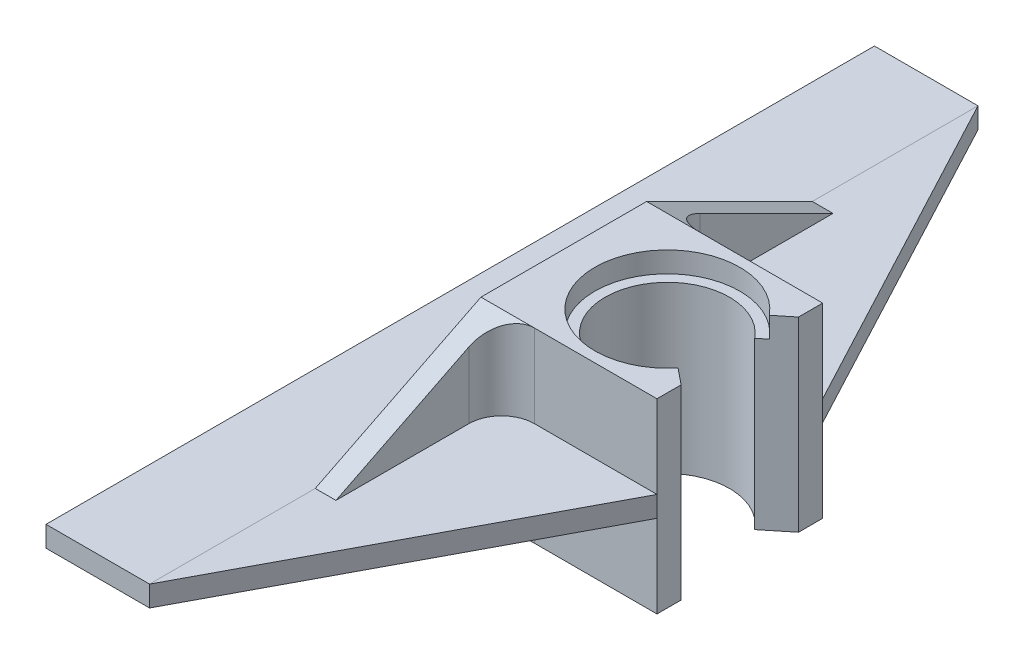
from build123d import *

# Parameters (mm, degrees)
EXTRUDE1_DEPTH = 9
SKETCH2_R      = 7
EXTRUDE2_DEPTH = 2
EXTRUDE3_DEPTH = 1
EXTRUDE4_DEPTH = 2
FILLET1_R      = 3.175


with BuildPart() as part:
    # Sketch1 → Extrude1 (new, symmetric)
    with BuildSketch(Plane(origin=(0, 0, 0), x_dir=(1, 0, 0), z_dir=(0, 1, 0))):
        with BuildLine():
            Line((-10, 8), (7, 8))
            Line((7, 8), (7, 5.668488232))
            Line((7, 5.668488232), (4.662875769, 3.775922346))
            ThreePointArc((4.662875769, 3.775922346), (-6, 0), (4.662875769, -3.775922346))
            Line((4.662875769, -3.775922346), (7, -5.668488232))
            Line((7, -5.668488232), (7, -8))
            Line((7, -8), (-10, -8))
            Line((-10, -8), (-10, 8))
        make_face()
    extrude(amount=EXTRUDE1_DEPTH, both=True)

    # Sketch2 → Extrude2 (cut)
    with BuildSketch(Plane(origin=(0, 9, 0), x_dir=(1, 0, 0), z_dir=(0, 1, 0))):
        Circle(SKETCH2_R)
    extrude(amount=-EXTRUDE2_DEPTH, mode=Mode.SUBTRACT)

    # Sketch3 → Extrude3 (add, symmetric)
    with BuildSketch(Plane(origin=(0, 0, 0), x_dir=(1, 0, 0), z_dir=(0, 1, 0))):
        Polygon((-10, 8), (-10, -8), (7, -8), (-10, -40), (-20, -40), (-20, 40), (-10, 40), (7, 8), align=None)
    extrude(amount=EXTRUDE3_DEPTH, both=True)

    # Sketch5 → Extrude4 (add)
    with BuildSketch(Plane.ZY.offset(10)):
        Polygon((-8, 9), (-26, 0), (-8, -9), (8, -9), (26, 0), (8, 9), align=None)
    extrude(amount=-EXTRUDE4_DEPTH)

    # Fillet1
    fillet1_edges = [part.edges().sort_by_distance(p)[0] for p in [
        (-8, -5, 8),
        (-8, -5, -8),
        (-8, 5, -8),
        (-8, 5, 8),
    ]]
    fillet(fillet1_edges, radius=FILLET1_R)


solid = part.part
